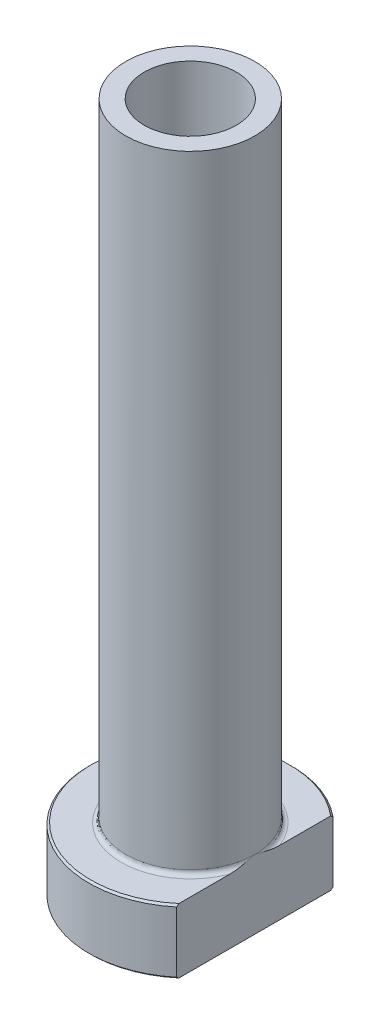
ISO-10303-21;
HEADER;
FILE_DESCRIPTION(('STEP AP214'),'2;1');
FILE_NAME('part.step','',(''),(''),'','','');
FILE_SCHEMA(('AUTOMOTIVE_DESIGN { 1 0 10303 214 1 1 1 1 }'));
ENDSEC;
DATA;
#1=APPLICATION_CONTEXT('core data for automotive mechanical design processes');
#2=APPLICATION_PROTOCOL_DEFINITION('international standard','automotive_design',2000,#1);
#3=PRODUCT_CONTEXT('',#1,'mechanical');
#4=PRODUCT('Part','Part','',(#3));
#5=PRODUCT_RELATED_PRODUCT_CATEGORY('part','',(#4));
#6=PRODUCT_DEFINITION_FORMATION('','',#4);
#7=PRODUCT_DEFINITION_CONTEXT('part definition',#1,'design');
#8=PRODUCT_DEFINITION('design','',#6,#7);
#9=PRODUCT_DEFINITION_SHAPE('','',#8);
#10=(LENGTH_UNIT() NAMED_UNIT(*) SI_UNIT(.MILLI.,.METRE.));
#11=(NAMED_UNIT(*) PLANE_ANGLE_UNIT() SI_UNIT($,.RADIAN.));
#12=(NAMED_UNIT(*) SI_UNIT($,.STERADIAN.) SOLID_ANGLE_UNIT());
#13=UNCERTAINTY_MEASURE_WITH_UNIT(LENGTH_MEASURE(1.E-05),#10,'distance_accuracy_value','');
#14=(GEOMETRIC_REPRESENTATION_CONTEXT(3) GLOBAL_UNCERTAINTY_ASSIGNED_CONTEXT((#13)) GLOBAL_UNIT_ASSIGNED_CONTEXT((#10,
#11,#12)) REPRESENTATION_CONTEXT('',''));
#15=CARTESIAN_POINT('',(0.,0.,0.));
#16=DIRECTION('',(0.,0.,1.));
#17=DIRECTION('',(1.,0.,0.));
#18=AXIS2_PLACEMENT_3D('',#15,#16,#17);
#19=CARTESIAN_POINT('',(0.,92.1876809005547,0.));
#20=DIRECTION('',(0.,1.,0.));
#21=DIRECTION('',(0.,0.,1.));
#22=AXIS2_PLACEMENT_3D('',#19,#20,#21);
#23=CYLINDRICAL_SURFACE('',#22,5.00000000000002);
#24=CARTESIAN_POINT('',(0.,75.,0.));
#25=DIRECTION('',(0.,1.,0.));
#26=DIRECTION('',(0.,0.,1.));
#27=AXIS2_PLACEMENT_3D('',#24,#25,#26);
#28=CIRCLE('',#27,5.00000000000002);
#29=CARTESIAN_POINT('',(0.,75.,5.00000000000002));
#30=VERTEX_POINT('',#29);
#31=EDGE_CURVE('E167',#30,#30,#28,.T.);
#32=ORIENTED_EDGE('',*,*,#31,.T.);
#33=EDGE_LOOP('',(#32));
#34=FACE_BOUND('',#33,.T.);
#35=CARTESIAN_POINT('',(0.,30.,0.));
#36=DIRECTION('',(0.,1.,0.));
#37=DIRECTION('',(0.,0.,1.));
#38=AXIS2_PLACEMENT_3D('',#35,#36,#37);
#39=CIRCLE('',#38,5.00000000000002);
#40=CARTESIAN_POINT('',(0.,30.,5.00000000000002));
#41=VERTEX_POINT('',#40);
#42=EDGE_CURVE('E170',#41,#41,#39,.T.);
#43=ORIENTED_EDGE('',*,*,#42,.F.);
#44=EDGE_LOOP('',(#43));
#45=FACE_BOUND('',#44,.T.);
#46=ADVANCED_FACE('F32',(#34,#45),#23,.F.);
#47=CARTESIAN_POINT('',(-5.00000000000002,75.,0.));
#48=DIRECTION('',(0.,1.,0.));
#49=DIRECTION('',(0.,0.,1.));
#50=AXIS2_PLACEMENT_3D('',#47,#48,#49);
#51=PLANE('',#50);
#52=CARTESIAN_POINT('',(0.,75.,0.));
#53=DIRECTION('',(0.,1.,0.));
#54=DIRECTION('',(0.,0.,1.));
#55=AXIS2_PLACEMENT_3D('',#52,#53,#54);
#56=CIRCLE('',#55,7.);
#57=CARTESIAN_POINT('',(0.,75.,7.));
#58=VERTEX_POINT('',#57);
#59=EDGE_CURVE('E174',#58,#58,#56,.T.);
#60=ORIENTED_EDGE('',*,*,#59,.T.);
#61=EDGE_LOOP('',(#60));
#62=FACE_BOUND('',#61,.T.);
#63=ORIENTED_EDGE('',*,*,#31,.F.);
#64=EDGE_LOOP('',(#63));
#65=FACE_BOUND('',#64,.T.);
#66=ADVANCED_FACE('F157',(#62,#65),#51,.T.);
#67=CARTESIAN_POINT('',(0.,92.1876809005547,0.));
#68=DIRECTION('',(0.,1.,0.));
#69=DIRECTION('',(0.,0.,1.));
#70=AXIS2_PLACEMENT_3D('',#67,#68,#69);
#71=CYLINDRICAL_SURFACE('',#70,6.99999999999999);
#72=CARTESIAN_POINT('',(0.,7.50000000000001,0.));
#73=DIRECTION('',(0.,1.,0.));
#74=DIRECTION('',(0.,0.,1.));
#75=AXIS2_PLACEMENT_3D('',#72,#73,#74);
#76=CIRCLE('',#75,6.99999999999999);
#77=CARTESIAN_POINT('',(6.99999999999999,7.50000000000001,0.));
#78=VERTEX_POINT('',#77);
#79=EDGE_CURVE('E180',#78,#78,#76,.T.);
#80=ORIENTED_EDGE('',*,*,#79,.T.);
#81=EDGE_LOOP('',(#80));
#82=FACE_BOUND('',#81,.T.);
#83=ORIENTED_EDGE('',*,*,#59,.F.);
#84=EDGE_LOOP('',(#83));
#85=FACE_BOUND('',#84,.T.);
#86=ADVANCED_FACE('F162',(#82,#85),#71,.T.);
#87=CARTESIAN_POINT('',(-6.99999999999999,7.,0.));
#88=DIRECTION('',(0.,1.,0.));
#89=DIRECTION('',(0.,0.,1.));
#90=AXIS2_PLACEMENT_3D('',#87,#88,#89);
#91=PLANE('',#90);
#92=DIRECTION('',(0.,0.,1.));
#93=VECTOR('',#92,1.);
#94=CARTESIAN_POINT('',(6.99999999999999,7.,0.));
#95=LINE('',#94,#93);
#96=CARTESIAN_POINT('',(7.,7.,-8.22435407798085));
#97=VERTEX_POINT('',#96);
#98=CARTESIAN_POINT('',(6.99999999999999,7.,-2.69258240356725));
#99=VERTEX_POINT('',#98);
#100=EDGE_CURVE('E54',#97,#99,#95,.T.);
#101=ORIENTED_EDGE('',*,*,#100,.F.);
#102=CARTESIAN_POINT('',(0.,7.,0.));
#103=DIRECTION('',(0.,1.,0.));
#104=DIRECTION('',(0.,0.,1.));
#105=AXIS2_PLACEMENT_3D('',#102,#103,#104);
#106=CIRCLE('',#105,10.8);
#107=CARTESIAN_POINT('',(6.99999999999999,7.,8.22435407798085));
#108=VERTEX_POINT('',#107);
#109=EDGE_CURVE('E186',#97,#108,#106,.T.);
#110=ORIENTED_EDGE('',*,*,#109,.T.);
#111=CARTESIAN_POINT('',(6.99999999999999,7.,2.69258240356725));
#112=VERTEX_POINT('',#111);
#113=EDGE_CURVE('E134',#112,#108,#95,.T.);
#114=ORIENTED_EDGE('',*,*,#113,.F.);
#115=CARTESIAN_POINT('',(0.,7.,0.));
#116=DIRECTION('',(0.,1.,0.));
#117=DIRECTION('',(0.,0.,1.));
#118=AXIS2_PLACEMENT_3D('',#115,#116,#117);
#119=CIRCLE('',#118,7.49999999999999);
#120=EDGE_CURVE('E183',#112,#99,#119,.F.);
#121=ORIENTED_EDGE('',*,*,#120,.T.);
#122=EDGE_LOOP('',(#101,#110,#114,#121));
#123=FACE_BOUND('',#122,.T.);
#124=ADVANCED_FACE('F197',(#123),#91,.T.);
#125=CARTESIAN_POINT('',(0.,92.1876809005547,0.));
#126=DIRECTION('',(0.,1.,0.));
#127=DIRECTION('',(0.,0.,1.));
#128=AXIS2_PLACEMENT_3D('',#125,#126,#127);
#129=CYLINDRICAL_SURFACE('',#128,11.);
#130=DIRECTION('',(0.,-1.,0.));
#131=VECTOR('',#130,1.);
#132=CARTESIAN_POINT('',(6.99999999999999,75.,8.48528137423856));
#133=LINE('',#132,#131);
#134=CARTESIAN_POINT('',(6.99999999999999,6.80000000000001,8.48528137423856));
#135=VERTEX_POINT('',#134);
#136=CARTESIAN_POINT('',(6.99999999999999,0.200000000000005,8.48528137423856));
#137=VERTEX_POINT('',#136);
#138=EDGE_CURVE('E82',#135,#137,#133,.T.);
#139=ORIENTED_EDGE('',*,*,#138,.F.);
#140=CARTESIAN_POINT('',(0.,6.80000000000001,0.));
#141=DIRECTION('',(0.,1.,0.));
#142=DIRECTION('',(0.,0.,1.));
#143=AXIS2_PLACEMENT_3D('',#140,#141,#142);
#144=CIRCLE('',#143,11.);
#145=CARTESIAN_POINT('',(7.,6.80000000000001,-8.48528137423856));
#146=VERTEX_POINT('',#145);
#147=EDGE_CURVE('E95',#135,#146,#144,.F.);
#148=ORIENTED_EDGE('',*,*,#147,.T.);
#149=DIRECTION('',(0.,-1.,0.));
#150=VECTOR('',#149,1.);
#151=CARTESIAN_POINT('',(7.,75.,-8.48528137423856));
#152=LINE('',#151,#150);
#153=CARTESIAN_POINT('',(7.,0.200000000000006,-8.48528137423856));
#154=VERTEX_POINT('',#153);
#155=EDGE_CURVE('E192',#146,#154,#152,.T.);
#156=ORIENTED_EDGE('',*,*,#155,.T.);
#157=CARTESIAN_POINT('',(0.,0.200000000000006,0.));
#158=DIRECTION('',(0.,-1.,0.));
#159=DIRECTION('',(0.,0.,-1.));
#160=AXIS2_PLACEMENT_3D('',#157,#158,#159);
#161=CIRCLE('',#160,11.);
#162=EDGE_CURVE('E98',#154,#137,#161,.F.);
#163=ORIENTED_EDGE('',*,*,#162,.T.);
#164=EDGE_LOOP('',(#139,#148,#156,#163));
#165=FACE_BOUND('',#164,.T.);
#166=ADVANCED_FACE('F190',(#165),#129,.T.);
#167=CARTESIAN_POINT('',(-11.,0.,0.));
#168=DIRECTION('',(0.,-1.,0.));
#169=DIRECTION('',(0.,0.,-1.));
#170=AXIS2_PLACEMENT_3D('',#167,#168,#169);
#171=PLANE('',#170);
#172=CARTESIAN_POINT('',(0.,0.,0.));
#173=DIRECTION('',(0.,-1.,0.));
#174=DIRECTION('',(0.,0.,-1.));
#175=AXIS2_PLACEMENT_3D('',#172,#173,#174);
#176=CIRCLE('',#175,5.74999999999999);
#177=CARTESIAN_POINT('',(0.,0.,-5.74999999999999));
#178=VERTEX_POINT('',#177);
#179=EDGE_CURVE('E40',#178,#178,#176,.F.);
#180=ORIENTED_EDGE('',*,*,#179,.T.);
#181=EDGE_LOOP('',(#180));
#182=FACE_BOUND('',#181,.T.);
#183=DIRECTION('',(0.,0.,-1.));
#184=VECTOR('',#183,1.);
#185=CARTESIAN_POINT('',(6.99999999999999,0.,8.48528137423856));
#186=LINE('',#185,#184);
#187=CARTESIAN_POINT('',(6.99999999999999,0.,8.22435407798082));
#188=VERTEX_POINT('',#187);
#189=CARTESIAN_POINT('',(7.,0.,-8.22435407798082));
#190=VERTEX_POINT('',#189);
#191=EDGE_CURVE('E47',#188,#190,#186,.T.);
#192=ORIENTED_EDGE('',*,*,#191,.F.);
#193=CARTESIAN_POINT('',(0.,0.,0.));
#194=DIRECTION('',(0.,-1.,0.));
#195=DIRECTION('',(0.,0.,-1.));
#196=AXIS2_PLACEMENT_3D('',#193,#194,#195);
#197=CIRCLE('',#196,10.8);
#198=EDGE_CURVE('E92',#188,#190,#197,.T.);
#199=ORIENTED_EDGE('',*,*,#198,.T.);
#200=EDGE_LOOP('',(#192,#199));
#201=FACE_BOUND('',#200,.T.);
#202=ADVANCED_FACE('F91',(#182,#201),#171,.T.);
#203=CARTESIAN_POINT('',(0.,92.1876809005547,0.));
#204=DIRECTION('',(0.,1.,0.));
#205=DIRECTION('',(0.,0.,1.));
#206=AXIS2_PLACEMENT_3D('',#203,#204,#205);
#207=CYLINDRICAL_SURFACE('',#206,5.24999999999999);
#208=CARTESIAN_POINT('',(0.,0.5,0.));
#209=DIRECTION('',(0.,-1.,0.));
#210=DIRECTION('',(0.,0.,-1.));
#211=AXIS2_PLACEMENT_3D('',#208,#209,#210);
#212=CIRCLE('',#211,5.24999999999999);
#213=CARTESIAN_POINT('',(0.,0.5,-5.24999999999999));
#214=VERTEX_POINT('',#213);
#215=EDGE_CURVE('E11',#214,#214,#212,.T.);
#216=ORIENTED_EDGE('',*,*,#215,.T.);
#217=EDGE_LOOP('',(#216));
#218=FACE_BOUND('',#217,.T.);
#219=CARTESIAN_POINT('',(0.,18.,0.));
#220=DIRECTION('',(0.,1.,0.));
#221=DIRECTION('',(0.,0.,1.));
#222=AXIS2_PLACEMENT_3D('',#219,#220,#221);
#223=CIRCLE('',#222,5.24999999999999);
#224=CARTESIAN_POINT('',(0.,18.,5.24999999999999));
#225=VERTEX_POINT('',#224);
#226=EDGE_CURVE('E172',#225,#225,#223,.T.);
#227=ORIENTED_EDGE('',*,*,#226,.T.);
#228=EDGE_LOOP('',(#227));
#229=FACE_BOUND('',#228,.T.);
#230=ADVANCED_FACE('F215',(#218,#229),#207,.F.);
#231=CARTESIAN_POINT('',(0.,18.,0.));
#232=DIRECTION('',(0.,-1.,0.));
#233=DIRECTION('',(0.,0.,-1.));
#234=AXIS2_PLACEMENT_3D('',#231,#232,#233);
#235=CONICAL_SURFACE('',#234,5.24999999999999,0.0208303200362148);
#236=ORIENTED_EDGE('',*,*,#42,.T.);
#237=EDGE_LOOP('',(#236));
#238=FACE_BOUND('',#237,.T.);
#239=ORIENTED_EDGE('',*,*,#226,.F.);
#240=EDGE_LOOP('',(#239));
#241=FACE_BOUND('',#240,.T.);
#242=ADVANCED_FACE('F111',(#238,#241),#235,.F.);
#243=CARTESIAN_POINT('',(0.,7.50000000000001,0.));
#244=DIRECTION('',(0.,1.,0.));
#245=DIRECTION('',(0.,0.,1.));
#246=AXIS2_PLACEMENT_3D('',#243,#244,#245);
#247=TOROIDAL_SURFACE('',#246,7.49999999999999,0.5);
#248=ORIENTED_EDGE('',*,*,#120,.F.);
#249=CARTESIAN_POINT('',(6.99999999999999,7.50000000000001,0.));
#250=CARTESIAN_POINT('',(6.99999999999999,7.5000008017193,-1.25554024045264E-10));
#251=CARTESIAN_POINT('',(7.,7.50000160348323,2.90220199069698E-07));
#252=CARTESIAN_POINT('',(7.,7.50000310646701,1.10846425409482E-06));
#253=CARTESIAN_POINT('',(7.,7.50000379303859,1.65470094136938E-06));
#254=CARTESIAN_POINT('',(7.,7.50000521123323,2.96102727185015E-06));
#255=CARTESIAN_POINT('',(7.,7.50000592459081,3.74204146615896E-06));
#256=CARTESIAN_POINT('',(7.,7.50000721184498,5.36891839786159E-06));
#257=CARTESIAN_POINT('',(7.,7.50000778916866,6.21226313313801E-06));
#258=CARTESIAN_POINT('',(7.,7.50000990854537,9.44889645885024E-06));
#259=CARTESIAN_POINT('',(7.,7.5000113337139,1.19224906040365E-05));
#260=CARTESIAN_POINT('',(7.,7.50001370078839,1.6845303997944E-05));
#261=CARTESIAN_POINT('',(7.,7.50001467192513,1.92810855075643E-05));
#262=CARTESIAN_POINT('',(7.,7.50001870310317,2.9505751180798E-05));
#263=CARTESIAN_POINT('',(7.,7.50002167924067,3.73333802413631E-05));
#264=CARTESIAN_POINT('',(7.,7.50002610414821,5.21820391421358E-05));
#265=CARTESIAN_POINT('',(7.,7.50002771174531,5.91555994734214E-05));
#266=CARTESIAN_POINT('',(7.,7.50003935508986,0.000110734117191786));
#267=CARTESIAN_POINT('',(7.,7.50004810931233,0.000155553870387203));
#268=CARTESIAN_POINT('',(7.,7.5000864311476,0.000332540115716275));
#269=CARTESIAN_POINT('',(7.,7.50012307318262,0.000463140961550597));
#270=CARTESIAN_POINT('',(7.,7.50026565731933,0.000980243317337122));
#271=CARTESIAN_POINT('',(7.,7.50036696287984,0.00136762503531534));
#272=CARTESIAN_POINT('',(7.,7.50077257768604,0.00290683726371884));
#273=CARTESIAN_POINT('',(7.,7.50108269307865,0.00405753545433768));
#274=CARTESIAN_POINT('',(7.,7.50237341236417,0.00885983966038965));
#275=CARTESIAN_POINT('',(7.,7.50334676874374,0.0125128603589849));
#276=CARTESIAN_POINT('',(7.,7.5162718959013,0.0610038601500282));
#277=CARTESIAN_POINT('',(7.,7.5282728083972,0.105832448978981));
#278=CARTESIAN_POINT('',(7.,7.55170994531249,0.193693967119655));
#279=CARTESIAN_POINT('',(7.,7.56314936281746,0.236726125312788));
#280=CARTESIAN_POINT('',(7.,7.5874041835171,0.328321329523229));
#281=CARTESIAN_POINT('',(7.,7.60020832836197,0.376887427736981));
#282=CARTESIAN_POINT('',(7.,7.62578161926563,0.474605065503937));
#283=CARTESIAN_POINT('',(7.,7.63854879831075,0.523757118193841));
#284=CARTESIAN_POINT('',(7.,7.66904753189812,0.642366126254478));
#285=CARTESIAN_POINT('',(7.,7.68665961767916,0.71185401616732));
#286=CARTESIAN_POINT('',(7.,7.72074501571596,0.849103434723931));
#287=CARTESIAN_POINT('',(7.,7.73723627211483,0.916860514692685));
#288=CARTESIAN_POINT('',(7.,7.79038156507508,1.14104210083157));
#289=CARTESIAN_POINT('',(7.,7.82528973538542,1.29788860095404));
#290=CARTESIAN_POINT('',(7.,7.88862298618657,1.61471917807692));
#291=CARTESIAN_POINT('',(7.,7.91697354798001,1.77471883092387));
#292=CARTESIAN_POINT('',(7.,7.95258292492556,2.02253505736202));
#293=CARTESIAN_POINT('',(7.,7.9635525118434,2.10981398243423));
#294=CARTESIAN_POINT('',(7.,7.98165287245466,2.28476193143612));
#295=CARTESIAN_POINT('',(7.,7.98878459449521,2.37243085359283));
#296=CARTESIAN_POINT('',(7.,7.99822919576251,2.54760327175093));
#297=CARTESIAN_POINT('',(7.,8.0005658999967,2.63510541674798));
#298=CARTESIAN_POINT('',(7.,7.99919996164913,2.81004074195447));
#299=CARTESIAN_POINT('',(7.,7.99550272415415,2.89747391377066));
#300=CARTESIAN_POINT('',(7.,7.98391011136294,3.02882076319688));
#301=CARTESIAN_POINT('',(7.,7.97897237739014,3.07299684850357));
#302=CARTESIAN_POINT('',(7.,7.9666545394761,3.1610540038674));
#303=CARTESIAN_POINT('',(7.,7.95927246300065,3.20493480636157));
#304=CARTESIAN_POINT('',(7.,7.94168688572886,3.29163191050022));
#305=CARTESIAN_POINT('',(7.,7.93151559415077,3.33445462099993));
#306=CARTESIAN_POINT('',(7.,7.90768392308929,3.41909658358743));
#307=CARTESIAN_POINT('',(7.,7.89402748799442,3.46091691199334));
#308=CARTESIAN_POINT('',(7.,7.8621470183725,3.54331777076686));
#309=CARTESIAN_POINT('',(7.,7.84387618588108,3.58388050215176));
#310=CARTESIAN_POINT('',(7.,7.8014589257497,3.66184445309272));
#311=CARTESIAN_POINT('',(7.,7.77733569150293,3.69925738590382));
#312=CARTESIAN_POINT('',(7.,7.7371401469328,3.74836513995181));
#313=CARTESIAN_POINT('',(7.,7.72423208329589,3.76263695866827));
#314=CARTESIAN_POINT('',(7.,7.6967376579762,3.78951670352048));
#315=CARTESIAN_POINT('',(7.,7.682150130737,3.80212346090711));
#316=CARTESIAN_POINT('',(7.,7.65099843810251,3.82514624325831));
#317=CARTESIAN_POINT('',(7.,7.63441049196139,3.83553078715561));
#318=CARTESIAN_POINT('',(7.,7.59955798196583,3.85294010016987));
#319=CARTESIAN_POINT('',(7.,7.58129885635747,3.85997533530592));
#320=CARTESIAN_POINT('',(7.,7.54906837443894,3.86837810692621));
#321=CARTESIAN_POINT('',(7.,7.53536870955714,3.87079233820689));
#322=CARTESIAN_POINT('',(7.,7.50775756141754,3.87325240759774));
#323=CARTESIAN_POINT('',(7.,7.49384618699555,3.87329942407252));
#324=CARTESIAN_POINT('',(7.,7.46623771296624,3.87102093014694));
#325=CARTESIAN_POINT('',(7.,7.45254041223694,3.8686978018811));
#326=CARTESIAN_POINT('',(7.,7.42569741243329,3.86188775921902));
#327=CARTESIAN_POINT('',(7.,7.4125521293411,3.85739924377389));
#328=CARTESIAN_POINT('',(7.,7.38259319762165,3.84468786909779));
#329=CARTESIAN_POINT('',(7.,7.36610215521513,3.83570823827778));
#330=CARTESIAN_POINT('',(7.,7.33476729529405,3.81523202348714));
#331=CARTESIAN_POINT('',(7.,7.31992737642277,3.80372966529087));
#332=CARTESIAN_POINT('',(7.,7.28371925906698,3.77170797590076));
#333=CARTESIAN_POINT('',(7.,7.26356272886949,3.7498305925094));
#334=CARTESIAN_POINT('',(7.,7.22671696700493,3.70338283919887));
#335=CARTESIAN_POINT('',(7.,7.21003361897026,3.67880800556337));
#336=CARTESIAN_POINT('',(7.,7.18026553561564,3.62921731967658));
#337=CARTESIAN_POINT('',(7.,7.16704475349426,3.60428175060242));
#338=CARTESIAN_POINT('',(7.,7.14275069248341,3.55337478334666));
#339=CARTESIAN_POINT('',(7.,7.13167947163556,3.52740242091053));
#340=CARTESIAN_POINT('',(7.,7.10104499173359,3.44809573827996));
#341=CARTESIAN_POINT('',(7.,7.08424174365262,3.39369851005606));
#342=CARTESIAN_POINT('',(7.,7.05431378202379,3.27667221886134));
#343=CARTESIAN_POINT('',(7.,7.04191718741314,3.21386807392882));
#344=CARTESIAN_POINT('',(7.,7.02234605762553,3.08735184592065));
#345=CARTESIAN_POINT('',(7.,7.01518234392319,3.02363815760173));
#346=CARTESIAN_POINT('',(7.,7.00517826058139,2.89779001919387));
#347=CARTESIAN_POINT('',(7.,7.00221627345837,2.83566460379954));
#348=CARTESIAN_POINT('',(7.,6.99952325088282,2.71160626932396));
#349=CARTESIAN_POINT('',(7.,6.99977918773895,2.64967358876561));
#350=CARTESIAN_POINT('',(7.,7.0037776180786,2.4940781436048));
#351=CARTESIAN_POINT('',(7.,7.00924384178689,2.40046113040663));
#352=CARTESIAN_POINT('',(7.,7.02494106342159,2.21367396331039));
#353=CARTESIAN_POINT('',(7.,7.03517106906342,2.12050372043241));
#354=CARTESIAN_POINT('',(7.,7.05969765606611,1.93249035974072));
#355=CARTESIAN_POINT('',(7.,7.07408383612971,1.83765914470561));
#356=CARTESIAN_POINT('',(7.,7.10603300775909,1.64829340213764));
#357=CARTESIAN_POINT('',(7.,7.12360402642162,1.55376025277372));
#358=CARTESIAN_POINT('',(7.,7.1680646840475,1.33086107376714));
#359=CARTESIAN_POINT('',(7.,7.19601783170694,1.20270896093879));
#360=CARTESIAN_POINT('',(7.,7.25475947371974,0.948586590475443));
#361=CARTESIAN_POINT('',(7.,7.28551257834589,0.822607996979));
#362=CARTESIAN_POINT('',(7.,7.33123897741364,0.641334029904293));
#363=CARTESIAN_POINT('',(7.,7.34543722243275,0.585840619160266));
#364=CARTESIAN_POINT('',(7.,7.37418243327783,0.474686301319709));
#365=CARTESIAN_POINT('',(7.,7.38873064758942,0.419025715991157));
#366=CARTESIAN_POINT('',(7.,7.41873357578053,0.305011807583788));
#367=CARTESIAN_POINT('',(7.,7.43419762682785,0.246660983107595));
#368=CARTESIAN_POINT('',(7.,7.46502361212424,0.130933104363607));
#369=CARTESIAN_POINT('',(7.,7.48038319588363,0.0735554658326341));
#370=CARTESIAN_POINT('',(7.,7.49665455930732,0.0125077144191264));
#371=CARTESIAN_POINT('',(7.,7.49762931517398,0.00884956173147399));
#372=CARTESIAN_POINT('',(7.,7.49892036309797,0.00404608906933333));
#373=CARTESIAN_POINT('',(7.,7.49922940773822,0.0028993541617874));
#374=CARTESIAN_POINT('',(7.,7.49963371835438,0.00136508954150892));
#375=CARTESIAN_POINT('',(7.,7.49973476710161,0.000978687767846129));
#376=CARTESIAN_POINT('',(7.,7.49987704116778,0.000462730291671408));
#377=CARTESIAN_POINT('',(7.,7.49991363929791,0.000332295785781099));
#378=CARTESIAN_POINT('',(7.,7.49995192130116,0.000155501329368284));
#379=CARTESIAN_POINT('',(7.,7.49996067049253,0.000110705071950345));
#380=CARTESIAN_POINT('',(7.,7.49997230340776,5.91504837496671E-05));
#381=CARTESIAN_POINT('',(7.,7.49997390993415,5.21782439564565E-05));
#382=CARTESIAN_POINT('',(7.,7.49997833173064,3.73322789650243E-05));
#383=CARTESIAN_POINT('',(7.,7.49998130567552,2.95059531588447E-05));
#384=CARTESIAN_POINT('',(7.,7.49998533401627,1.92826342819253E-05));
#385=CARTESIAN_POINT('',(7.,7.4999863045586,1.68469515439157E-05));
#386=CARTESIAN_POINT('',(7.,7.49998867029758,1.19242365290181E-05));
#387=CARTESIAN_POINT('',(7.,7.49999009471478,9.45062992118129E-06));
#388=CARTESIAN_POINT('',(7.,7.499992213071,6.21386409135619E-06));
#389=CARTESIAN_POINT('',(7.,7.49999279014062,5.37045268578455E-06));
#390=CARTESIAN_POINT('',(7.,7.4999940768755,3.74339655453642E-06));
#391=CARTESIAN_POINT('',(7.,7.49999478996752,2.96226828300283E-06));
#392=CARTESIAN_POINT('',(7.,7.49999620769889,1.65567322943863E-06));
#393=CARTESIAN_POINT('',(7.,7.49999689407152,1.10929173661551E-06));
#394=CARTESIAN_POINT('',(7.,7.49999839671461,2.90683077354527E-07));
#395=CARTESIAN_POINT('',(6.99999999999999,7.49999919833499,1.25546956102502E-10));
#396=CARTESIAN_POINT('',(6.99999999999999,7.50000000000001,0.));
#397=B_SPLINE_CURVE_WITH_KNOTS('',3,(#249,#250,#251,#252,#253,#254,#255,#256,#257,#258,#259,
#260,#261,#262,#263,#264,#265,#266,#267,#268,#269,#270,#271,#272,#273,#274,#275,#276,#277,#278,
#279,#280,#281,#282,#283,#284,#285,#286,#287,#288,#289,#290,#291,#292,#293,#294,#295,#296,#297,
#298,#299,#300,#301,#302,#303,#304,#305,#306,#307,#308,#309,#310,#311,#312,#313,#314,#315,#316,
#317,#318,#319,#320,#321,#322,#323,#324,#325,#326,#327,#328,#329,#330,#331,#332,#333,#334,#335,
#336,#337,#338,#339,#340,#341,#342,#343,#344,#345,#346,#347,#348,#349,#350,#351,#352,#353,#354,
#355,#356,#357,#358,#359,#360,#361,#362,#363,#364,#365,#366,#367,#368,#369,#370,#371,#372,#373,
#374,#375,#376,#377,#378,#379,#380,#381,#382,#383,#384,#385,#386,#387,#388,#389,#390,#391,#392,
#393,#394,#395,#396),.UNSPECIFIED.,.T.,.F.,(4,2,2,2,2,2,2,2,2,2,2,2,2,2,2,2,2,2,2,2,2,2,2,2,2,2,
2,2,2,2,2,2,2,2,2,2,2,2,2,2,2,2,2,2,2,2,2,2,2,2,2,2,2,2,2,2,2,2,2,2,2,2,2,2,2,2,2,2,2,2,2,2,2,
4),(0.,2.42201532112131E-06,5.05305063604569E-06,8.20814364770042E-06,1.12722964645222E-05,
1.98044055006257E-05,2.7664211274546E-05,5.27403892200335E-05,7.4183084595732E-05,
0.000211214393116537,0.00061773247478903,0.00181938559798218,0.00539412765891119,
0.016736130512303,0.155952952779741,0.289534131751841,0.440210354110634,0.592559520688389,
0.80761174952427,1.01681499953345,1.49878389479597,1.98598665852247,2.24981935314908,
2.51358682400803,2.77604050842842,3.03825922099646,3.17156039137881,3.30496939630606,
3.43689837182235,3.56867869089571,3.70185328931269,3.83450849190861,3.89212877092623,
3.94978928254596,4.00821928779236,4.06646549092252,4.10801107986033,4.14953598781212,
4.19101920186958,4.23253313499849,4.28854866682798,4.34469377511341,4.43343413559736,
4.52232362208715,4.60686785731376,4.69149264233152,4.86185145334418,5.05362927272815,
5.24580256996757,5.43229132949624,5.6180253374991,5.89918385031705,6.18028382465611,
6.46796485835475,6.75638131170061,7.14981284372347,7.53882346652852,7.71066604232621,
7.88325629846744,8.06435328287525,8.24254095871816,8.2538989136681,8.25746134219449,
8.25865995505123,8.25906595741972,8.25920291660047,8.25922435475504,8.25924942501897,
8.25925728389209,8.25926581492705,8.25926887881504,8.2592720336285,8.25927466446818,
8.25927708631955),.UNSPECIFIED.);
#398=EDGE_CURVE('E126',#112,#78,#397,.T.);
#399=ORIENTED_EDGE('',*,*,#398,.T.);
#400=ORIENTED_EDGE('',*,*,#79,.F.);
#401=CARTESIAN_POINT('',(6.99999999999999,7.50000000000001,0.));
#402=CARTESIAN_POINT('',(6.99999999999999,7.49999919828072,1.25555477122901E-10));
#403=CARTESIAN_POINT('',(7.,7.49999839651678,-2.90220197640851E-07));
#404=CARTESIAN_POINT('',(7.,7.49999689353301,-1.10846425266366E-06));
#405=CARTESIAN_POINT('',(7.,7.49999620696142,-1.65470093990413E-06));
#406=CARTESIAN_POINT('',(7.,7.49999478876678,-2.96102727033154E-06));
#407=CARTESIAN_POINT('',(7.,7.49999407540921,-3.74204146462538E-06));
#408=CARTESIAN_POINT('',(7.,7.49999278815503,-5.36891839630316E-06));
#409=CARTESIAN_POINT('',(7.,7.49999221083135,-6.21226313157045E-06));
#410=CARTESIAN_POINT('',(7.,7.49999009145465,-9.44889645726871E-06));
#411=CARTESIAN_POINT('',(7.,7.49998866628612,-1.19224906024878E-05));
#412=CARTESIAN_POINT('',(7.,7.49998629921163,-1.68453039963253E-05));
#413=CARTESIAN_POINT('',(7.,7.49998532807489,-1.92810855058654E-05));
#414=CARTESIAN_POINT('',(7.,7.49998129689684,-2.95057511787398E-05));
#415=CARTESIAN_POINT('',(7.,7.49997832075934,-3.73333802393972E-05));
#416=CARTESIAN_POINT('',(7.,7.4999738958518,-5.21820391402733E-05));
#417=CARTESIAN_POINT('',(7.,7.4999722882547,-5.91555994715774E-05));
#418=CARTESIAN_POINT('',(7.,7.49996064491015,-0.000110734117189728));
#419=CARTESIAN_POINT('',(7.,7.49995189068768,-0.000155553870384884));
#420=CARTESIAN_POINT('',(7.,7.49991356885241,-0.000332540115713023));
#421=CARTESIAN_POINT('',(7.,7.49987692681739,-0.000463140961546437));
#422=CARTESIAN_POINT('',(7.,7.49973434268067,-0.000980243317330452));
#423=CARTESIAN_POINT('',(7.,7.49963303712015,-0.00136762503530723));
#424=CARTESIAN_POINT('',(7.,7.49922742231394,-0.00290683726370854));
#425=CARTESIAN_POINT('',(7.,7.49891730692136,-0.00405753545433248));
#426=CARTESIAN_POINT('',(7.,7.49762658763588,-0.00885983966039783));
#427=CARTESIAN_POINT('',(7.,7.49665323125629,-0.0125128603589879));
#428=CARTESIAN_POINT('',(7.,7.48372810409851,-0.0610038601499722));
#429=CARTESIAN_POINT('',(7.,7.47172719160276,-0.105832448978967));
#430=CARTESIAN_POINT('',(7.,7.44829005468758,-0.193693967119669));
#431=CARTESIAN_POINT('',(7.,7.43685063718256,-0.23672612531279));
#432=CARTESIAN_POINT('',(7.,7.4125958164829,-0.328321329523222));
#433=CARTESIAN_POINT('',(7.,7.39979167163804,-0.376887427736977));
#434=CARTESIAN_POINT('',(7.,7.37421838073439,-0.474605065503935));
#435=CARTESIAN_POINT('',(7.,7.36145120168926,-0.523757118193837));
#436=CARTESIAN_POINT('',(7.,7.33095246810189,-0.642366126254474));
#437=CARTESIAN_POINT('',(7.,7.31334038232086,-0.711854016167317));
#438=CARTESIAN_POINT('',(7.,7.27925498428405,-0.84910343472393));
#439=CARTESIAN_POINT('',(7.,7.26276372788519,-0.916860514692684));
#440=CARTESIAN_POINT('',(7.,7.20961843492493,-1.14104210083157));
#441=CARTESIAN_POINT('',(7.,7.17471026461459,-1.29788860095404));
#442=CARTESIAN_POINT('',(7.,7.11137701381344,-1.61471917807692));
#443=CARTESIAN_POINT('',(7.,7.08302645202,-1.77471883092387));
#444=CARTESIAN_POINT('',(7.,7.04741707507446,-2.02253505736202));
#445=CARTESIAN_POINT('',(7.,7.03644748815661,-2.10981398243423));
#446=CARTESIAN_POINT('',(7.,7.01834712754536,-2.28476193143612));
#447=CARTESIAN_POINT('',(7.,7.0112154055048,-2.37243085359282));
#448=CARTESIAN_POINT('',(7.,7.0017708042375,-2.54760327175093));
#449=CARTESIAN_POINT('',(7.,6.99943410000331,-2.63510541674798));
#450=CARTESIAN_POINT('',(7.,7.00080003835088,-2.81004074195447));
#451=CARTESIAN_POINT('',(7.,7.00449727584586,-2.89747391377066));
#452=CARTESIAN_POINT('',(7.,7.01608988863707,-3.02882076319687));
#453=CARTESIAN_POINT('',(7.,7.02102762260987,-3.07299684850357));
#454=CARTESIAN_POINT('',(7.,7.03334546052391,-3.1610540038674));
#455=CARTESIAN_POINT('',(7.,7.04072753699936,-3.20493480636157));
#456=CARTESIAN_POINT('',(7.,7.05831311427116,-3.29163191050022));
#457=CARTESIAN_POINT('',(7.,7.06848440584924,-3.33445462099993));
#458=CARTESIAN_POINT('',(7.,7.09231607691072,-3.41909658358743));
#459=CARTESIAN_POINT('',(7.,7.10597251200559,-3.46091691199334));
#460=CARTESIAN_POINT('',(7.,7.13785298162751,-3.54331777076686));
#461=CARTESIAN_POINT('',(7.,7.15612381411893,-3.58388050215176));
#462=CARTESIAN_POINT('',(7.,7.19854107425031,-3.66184445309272));
#463=CARTESIAN_POINT('',(7.,7.22266430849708,-3.69925738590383));
#464=CARTESIAN_POINT('',(7.,7.26285985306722,-3.74836513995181));
#465=CARTESIAN_POINT('',(7.,7.27576791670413,-3.76263695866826));
#466=CARTESIAN_POINT('',(7.,7.30326234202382,-3.78951670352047));
#467=CARTESIAN_POINT('',(7.,7.31784986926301,-3.80212346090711));
#468=CARTESIAN_POINT('',(7.,7.3490015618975,-3.82514624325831));
#469=CARTESIAN_POINT('',(7.,7.36558950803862,-3.83553078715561));
#470=CARTESIAN_POINT('',(7.,7.40044201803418,-3.85294010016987));
#471=CARTESIAN_POINT('',(7.,7.41870114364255,-3.85997533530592));
#472=CARTESIAN_POINT('',(7.,7.45093162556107,-3.86837810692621));
#473=CARTESIAN_POINT('',(7.,7.46463129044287,-3.87079233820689));
#474=CARTESIAN_POINT('',(7.,7.49224243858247,-3.87325240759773));
#475=CARTESIAN_POINT('',(7.,7.50615381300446,-3.87329942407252));
#476=CARTESIAN_POINT('',(7.,7.53376228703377,-3.87102093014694));
#477=CARTESIAN_POINT('',(7.,7.54745958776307,-3.8686978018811));
#478=CARTESIAN_POINT('',(7.,7.57430258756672,-3.86188775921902));
#479=CARTESIAN_POINT('',(7.,7.58744787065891,-3.85739924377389));
#480=CARTESIAN_POINT('',(7.,7.61740680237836,-3.84468786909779));
#481=CARTESIAN_POINT('',(7.,7.63389784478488,-3.83570823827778));
#482=CARTESIAN_POINT('',(7.,7.66523270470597,-3.81523202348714));
#483=CARTESIAN_POINT('',(7.,7.68007262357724,-3.80372966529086));
#484=CARTESIAN_POINT('',(7.,7.71628074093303,-3.77170797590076));
#485=CARTESIAN_POINT('',(7.,7.73643727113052,-3.7498305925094));
#486=CARTESIAN_POINT('',(7.,7.77328303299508,-3.70338283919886));
#487=CARTESIAN_POINT('',(7.,7.78996638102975,-3.67880800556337));
#488=CARTESIAN_POINT('',(7.,7.81973446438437,-3.62921731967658));
#489=CARTESIAN_POINT('',(7.,7.83295524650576,-3.60428175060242));
#490=CARTESIAN_POINT('',(7.,7.8572493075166,-3.55337478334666));
#491=CARTESIAN_POINT('',(7.,7.86832052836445,-3.52740242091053));
#492=CARTESIAN_POINT('',(7.,7.89895500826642,-3.44809573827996));
#493=CARTESIAN_POINT('',(7.,7.91575825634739,-3.39369851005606));
#494=CARTESIAN_POINT('',(7.,7.94568621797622,-3.27667221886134));
#495=CARTESIAN_POINT('',(7.,7.95808281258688,-3.21386807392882));
#496=CARTESIAN_POINT('',(7.,7.97765394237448,-3.08735184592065));
#497=CARTESIAN_POINT('',(7.,7.98481765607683,-3.02363815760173));
#498=CARTESIAN_POINT('',(7.,7.99482173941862,-2.89779001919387));
#499=CARTESIAN_POINT('',(7.,7.99778372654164,-2.83566460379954));
#500=CARTESIAN_POINT('',(7.,8.00047674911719,-2.71160626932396));
#501=CARTESIAN_POINT('',(7.,8.00022081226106,-2.64967358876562));
#502=CARTESIAN_POINT('',(7.,7.99622238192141,-2.49407814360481));
#503=CARTESIAN_POINT('',(7.,7.99075615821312,-2.40046113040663));
#504=CARTESIAN_POINT('',(7.,7.97505893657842,-2.21367396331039));
#505=CARTESIAN_POINT('',(7.,7.9648289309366,-2.12050372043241));
#506=CARTESIAN_POINT('',(7.,7.9403023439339,-1.93249035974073));
#507=CARTESIAN_POINT('',(7.,7.92591616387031,-1.83765914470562));
#508=CARTESIAN_POINT('',(7.,7.89396699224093,-1.64829340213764));
#509=CARTESIAN_POINT('',(7.,7.87639597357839,-1.55376025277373));
#510=CARTESIAN_POINT('',(7.,7.83193531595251,-1.33086107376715));
#511=CARTESIAN_POINT('',(7.,7.80398216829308,-1.2027089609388));
#512=CARTESIAN_POINT('',(7.,7.74524052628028,-0.948586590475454));
#513=CARTESIAN_POINT('',(7.,7.71448742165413,-0.822607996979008));
#514=CARTESIAN_POINT('',(7.,7.66876102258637,-0.641334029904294));
#515=CARTESIAN_POINT('',(7.,7.65456277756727,-0.585840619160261));
#516=CARTESIAN_POINT('',(7.,7.62581756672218,-0.474686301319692));
#517=CARTESIAN_POINT('',(7.,7.61126935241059,-0.419025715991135));
#518=CARTESIAN_POINT('',(7.,7.58126642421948,-0.305011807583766));
#519=CARTESIAN_POINT('',(7.,7.56580237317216,-0.246660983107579));
#520=CARTESIAN_POINT('',(7.,7.53497638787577,-0.130933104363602));
#521=CARTESIAN_POINT('',(7.,7.51961680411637,-0.0735554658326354));
#522=CARTESIAN_POINT('',(7.,7.50334544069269,-0.0125077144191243));
#523=CARTESIAN_POINT('',(7.,7.50237068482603,-0.00884956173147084));
#524=CARTESIAN_POINT('',(7.,7.50107963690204,-0.00404608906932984));
#525=CARTESIAN_POINT('',(7.,7.50077059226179,-0.00289935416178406));
#526=CARTESIAN_POINT('',(7.,7.50036628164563,-0.00136508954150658));
#527=CARTESIAN_POINT('',(7.,7.5002652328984,-0.000978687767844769));
#528=CARTESIAN_POINT('',(7.,7.50012295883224,-0.000462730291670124));
#529=CARTESIAN_POINT('',(7.,7.50008636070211,-0.000332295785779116));
#530=CARTESIAN_POINT('',(7.,7.50004807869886,-0.000155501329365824));
#531=CARTESIAN_POINT('',(7.,7.50003932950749,-0.000110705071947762));
#532=CARTESIAN_POINT('',(7.,7.50002769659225,-5.9150483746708E-05));
#533=CARTESIAN_POINT('',(7.,7.50002609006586,-5.21782439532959E-05));
#534=CARTESIAN_POINT('',(7.,7.50002166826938,-3.733227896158E-05));
#535=CARTESIAN_POINT('',(7.,7.50001869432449,-2.9505953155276E-05));
#536=CARTESIAN_POINT('',(7.,7.50001466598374,-1.92826342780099E-05));
#537=CARTESIAN_POINT('',(7.,7.50001369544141,-1.68469515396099E-05));
#538=CARTESIAN_POINT('',(7.,7.50001132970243,-1.19242365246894E-05));
#539=CARTESIAN_POINT('',(7.,7.50000990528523,-9.45062991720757E-06));
#540=CARTESIAN_POINT('',(7.,7.50000778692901,-6.21386408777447E-06));
#541=CARTESIAN_POINT('',(7.,7.5000072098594,-5.37045268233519E-06));
#542=CARTESIAN_POINT('',(7.,7.50000592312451,-3.74339655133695E-06));
#543=CARTESIAN_POINT('',(7.,7.50000521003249,-2.96226827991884E-06));
#544=CARTESIAN_POINT('',(7.,7.50000379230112,-1.65567322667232E-06));
#545=CARTESIAN_POINT('',(7.,7.50000310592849,-1.10929173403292E-06));
#546=CARTESIAN_POINT('',(7.,7.5000016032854,-2.90683075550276E-07));
#547=CARTESIAN_POINT('',(6.99999999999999,7.50000080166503,-1.25545546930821E-10));
#548=CARTESIAN_POINT('',(6.99999999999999,7.50000000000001,0.));
#549=B_SPLINE_CURVE_WITH_KNOTS('',3,(#401,#402,#403,#404,#405,#406,#407,#408,#409,#410,#411,
#412,#413,#414,#415,#416,#417,#418,#419,#420,#421,#422,#423,#424,#425,#426,#427,#428,#429,#430,
#431,#432,#433,#434,#435,#436,#437,#438,#439,#440,#441,#442,#443,#444,#445,#446,#447,#448,#449,
#450,#451,#452,#453,#454,#455,#456,#457,#458,#459,#460,#461,#462,#463,#464,#465,#466,#467,#468,
#469,#470,#471,#472,#473,#474,#475,#476,#477,#478,#479,#480,#481,#482,#483,#484,#485,#486,#487,
#488,#489,#490,#491,#492,#493,#494,#495,#496,#497,#498,#499,#500,#501,#502,#503,#504,#505,#506,
#507,#508,#509,#510,#511,#512,#513,#514,#515,#516,#517,#518,#519,#520,#521,#522,#523,#524,#525,
#526,#527,#528,#529,#530,#531,#532,#533,#534,#535,#536,#537,#538,#539,#540,#541,#542,#543,#544,
#545,#546,#547,#548),.UNSPECIFIED.,.T.,.F.,(4,2,2,2,2,2,2,2,2,2,2,2,2,2,2,2,2,2,2,2,2,2,2,2,2,2,
2,2,2,2,2,2,2,2,2,2,2,2,2,2,2,2,2,2,2,2,2,2,2,2,2,2,2,2,2,2,2,2,2,2,2,2,2,2,2,2,2,2,2,2,2,2,2,
4),(0.,2.42201532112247E-06,5.05305063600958E-06,8.20814364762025E-06,1.12722964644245E-05,
1.98044055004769E-05,2.76642112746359E-05,5.27403892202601E-05,7.4183084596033E-05,
0.000211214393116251,0.000617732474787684,0.0018193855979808,0.00539412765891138,
0.016736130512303,0.155952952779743,0.289534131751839,0.440210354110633,0.592559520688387,
0.807611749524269,1.01681499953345,1.49878389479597,1.98598665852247,2.24981935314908,
2.51358682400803,2.77604050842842,3.03825922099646,3.17156039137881,3.30496939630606,
3.43689837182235,3.56867869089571,3.70185328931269,3.83450849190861,3.89212877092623,
3.94978928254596,4.00821928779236,4.06646549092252,4.10801107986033,4.14953598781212,
4.19101920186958,4.23253313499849,4.28854866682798,4.34469377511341,4.43343413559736,
4.52232362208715,4.60686785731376,4.69149264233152,4.86185145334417,5.05362927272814,
5.24580256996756,5.43229132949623,5.61802533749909,5.89918385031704,6.1802838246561,
6.46796485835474,6.75638131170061,7.14981284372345,7.53882346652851,7.71066604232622,
7.88325629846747,8.06435328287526,8.24254095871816,8.2538989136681,8.25746134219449,
8.25865995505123,8.25906595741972,8.25920291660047,8.25922435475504,8.25924942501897,
8.25925728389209,8.25926581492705,8.25926887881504,8.2592720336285,8.25927466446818,
8.25927708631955),.UNSPECIFIED.);
#550=EDGE_CURVE('E135',#78,#99,#549,.T.);
#551=ORIENTED_EDGE('',*,*,#550,.T.);
#552=EDGE_LOOP('',(#248,#399,#400,#551));
#553=FACE_BOUND('',#552,.T.);
#554=ADVANCED_FACE('F141',(#553),#247,.F.);
#555=CARTESIAN_POINT('',(0.,7.00000000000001,0.));
#556=DIRECTION('',(0.,-1.,0.));
#557=DIRECTION('',(0.,0.,-1.));
#558=AXIS2_PLACEMENT_3D('',#555,#556,#557);
#559=CONICAL_SURFACE('',#558,10.8,0.785398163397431);
#560=CARTESIAN_POINT('',(7.,-2.13774979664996,-18.6685261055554));
#561=CARTESIAN_POINT('',(7.,-1.86574872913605,-18.3780244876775));
#562=CARTESIAN_POINT('',(7.,-1.59415659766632,-18.0871392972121));
#563=CARTESIAN_POINT('',(7.,-1.0519287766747,-17.5044755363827));
#564=CARTESIAN_POINT('',(7.,-0.781293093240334,-17.2126969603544));
#565=CARTESIAN_POINT('',(7.,-0.241050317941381,-16.628048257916));
#566=CARTESIAN_POINT('',(7.,0.0285564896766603,-16.3351778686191));
#567=CARTESIAN_POINT('',(7.,0.566485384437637,-15.7482616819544));
#568=CARTESIAN_POINT('',(7.,0.834807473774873,-15.4542158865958));
#569=CARTESIAN_POINT('',(7.,1.64198377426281,-14.5651645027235));
#570=CARTESIAN_POINT('',(7.,2.17856420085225,-13.9680841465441));
#571=CARTESIAN_POINT('',(7.,2.97696333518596,-13.0668144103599));
#572=CARTESIAN_POINT('',(7.,3.24199785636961,-12.7654727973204));
#573=CARTESIAN_POINT('',(7.,3.76945856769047,-12.1605141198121));
#574=CARTESIAN_POINT('',(7.,4.03188476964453,-11.856897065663));
#575=CARTESIAN_POINT('',(7.,4.50733797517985,-11.3009625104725));
#576=CARTESIAN_POINT('',(7.,4.72088020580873,-11.0490858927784));
#577=CARTESIAN_POINT('',(7.,5.14538078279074,-10.5431655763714));
#578=CARTESIAN_POINT('',(7.,5.3563391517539,-10.2891218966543));
#579=CARTESIAN_POINT('',(7.,5.77522964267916,-9.77836737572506));
#580=CARTESIAN_POINT('',(7.,5.98316044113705,-9.5216554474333));
#581=CARTESIAN_POINT('',(7.,6.39521098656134,-9.00519084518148));
#582=CARTESIAN_POINT('',(7.,6.59933078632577,-8.74543821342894));
#583=CARTESIAN_POINT('',(7.,7.00243445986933,-8.22283607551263));
#584=CARTESIAN_POINT('',(7.,7.20142819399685,-7.95999419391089));
#585=CARTESIAN_POINT('',(7.,7.59353840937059,-7.42991856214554));
#586=CARTESIAN_POINT('',(7.,7.78665447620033,-7.16268450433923));
#587=CARTESIAN_POINT('',(7.,8.16523718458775,-6.62311113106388));
#588=CARTESIAN_POINT('',(7.,8.3507091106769,-6.35077553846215));
#589=CARTESIAN_POINT('',(7.,8.71189725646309,-5.79973731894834));
#590=CARTESIAN_POINT('',(7.,8.88761537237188,-5.52103594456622));
#591=CARTESIAN_POINT('',(7.,9.19554959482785,-5.00707921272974));
#592=CARTESIAN_POINT('',(7.,9.32988075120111,-4.77309669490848));
#593=CARTESIAN_POINT('',(7.,9.58764253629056,-4.29911523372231));
#594=CARTESIAN_POINT('',(7.,9.71107181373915,-4.05911554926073));
#595=CARTESIAN_POINT('',(7.,9.94390907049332,-3.57263619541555));
#596=CARTESIAN_POINT('',(7.,10.0533307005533,-3.32616312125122));
#597=CARTESIAN_POINT('',(7.,10.2545146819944,-2.82607166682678));
#598=CARTESIAN_POINT('',(7.,10.3462820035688,-2.57245532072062));
#599=CARTESIAN_POINT('',(7.,10.4907049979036,-2.11254447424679));
#600=CARTESIAN_POINT('',(7.,10.5475277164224,-1.90756611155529));
#601=CARTESIAN_POINT('',(7.,10.6452043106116,-1.49381161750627));
#602=CARTESIAN_POINT('',(7.,10.68606033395,-1.28503600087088));
#603=CARTESIAN_POINT('',(7.,10.749755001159,-0.865342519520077));
#604=CARTESIAN_POINT('',(7.,10.772646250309,-0.654432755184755));
#605=CARTESIAN_POINT('',(7.,10.7993569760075,-0.231396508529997));
#606=CARTESIAN_POINT('',(7.,10.8031771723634,-0.0192700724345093));
#607=CARTESIAN_POINT('',(7.,10.791517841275,0.404715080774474));
#608=CARTESIAN_POINT('',(7.,10.7760135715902,0.616573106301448));
#609=CARTESIAN_POINT('',(7.,10.726541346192,1.03810446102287));
#610=CARTESIAN_POINT('',(7.,10.692571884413,1.24777761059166));
#611=CARTESIAN_POINT('',(7.,10.6077703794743,1.66430273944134));
#612=CARTESIAN_POINT('',(7.,10.5568873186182,1.87114418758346));
#613=CARTESIAN_POINT('',(7.,10.4404729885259,2.2806127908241));
#614=CARTESIAN_POINT('',(7.,10.3749414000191,2.48323985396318));
#615=CARTESIAN_POINT('',(7.,10.2190980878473,2.91860265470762));
#616=CARTESIAN_POINT('',(7.,10.126461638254,3.15050038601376));
#617=CARTESIAN_POINT('',(7.,9.92740958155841,3.6083545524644));
#618=CARTESIAN_POINT('',(7.,9.82098769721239,3.83430822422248));
#619=CARTESIAN_POINT('',(7.,9.59695142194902,4.28105341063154));
#620=CARTESIAN_POINT('',(6.99999999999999,9.47931762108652,4.50183511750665));
#621=CARTESIAN_POINT('',(6.99999999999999,9.23524231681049,4.93840249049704));
#622=CARTESIAN_POINT('',(6.99999999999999,9.10880204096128,5.15418884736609));
#623=CARTESIAN_POINT('',(6.99999999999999,8.84714657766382,5.58417945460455));
#624=CARTESIAN_POINT('',(6.99999999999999,8.71183920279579,5.798327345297));
#625=CARTESIAN_POINT('',(6.99999999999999,8.43533082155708,6.22277635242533));
#626=CARTESIAN_POINT('',(6.99999999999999,8.29412966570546,6.43307737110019));
#627=CARTESIAN_POINT('',(6.99999999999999,8.00706556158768,6.85014007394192));
#628=CARTESIAN_POINT('',(6.99999999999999,7.86120763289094,7.05690522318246));
#629=CARTESIAN_POINT('',(6.99999999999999,7.56553131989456,7.46757278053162));
#630=CARTESIAN_POINT('',(6.99999999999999,7.41571298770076,7.67147522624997));
#631=CARTESIAN_POINT('',(6.99999999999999,7.07999705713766,8.12067189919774));
#632=CARTESIAN_POINT('',(6.99999999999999,6.89330819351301,8.3653740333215));
#633=CARTESIAN_POINT('',(6.99999999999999,6.5159718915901,8.85171196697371));
#634=CARTESIAN_POINT('',(6.99999999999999,6.32532432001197,9.09334766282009));
#635=CARTESIAN_POINT('',(6.99999999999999,5.94076020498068,9.57404667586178));
#636=CARTESIAN_POINT('',(6.99999999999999,5.74684327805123,9.81310968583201));
#637=CARTESIAN_POINT('',(6.99999999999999,5.35630729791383,10.2890203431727));
#638=CARTESIAN_POINT('',(6.99999999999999,5.15968820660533,10.5258679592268));
#639=CARTESIAN_POINT('',(6.99999999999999,4.56606953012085,11.2340330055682));
#640=CARTESIAN_POINT('',(6.99999999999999,4.1656814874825,11.7025100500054));
#641=CARTESIAN_POINT('',(6.99999999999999,3.35840033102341,12.6338245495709));
#642=CARTESIAN_POINT('',(6.99999999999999,2.95150704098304,13.0966618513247));
#643=CARTESIAN_POINT('',(6.99999999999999,2.35017562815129,13.773410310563));
#644=CARTESIAN_POINT('',(6.99999999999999,2.15763812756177,13.9890143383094));
#645=CARTESIAN_POINT('',(6.99999999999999,1.77161609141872,14.4193671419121));
#646=CARTESIAN_POINT('',(6.99999999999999,1.57813157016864,14.6341159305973));
#647=CARTESIAN_POINT('',(6.99999999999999,0.996412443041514,15.2772388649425));
#648=CARTESIAN_POINT('',(6.99999999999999,0.606922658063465,15.7044779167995));
#649=CARTESIAN_POINT('',(6.99999999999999,-0.173895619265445,16.5556520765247));
#650=CARTESIAN_POINT('',(6.99999999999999,-0.565218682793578,16.9795921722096));
#651=CARTESIAN_POINT('',(6.99999999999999,-1.34999931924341,17.8254589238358));
#652=CARTESIAN_POINT('',(6.99999999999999,-1.74345679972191,18.2473856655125));
#653=CARTESIAN_POINT('',(6.99999999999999,-2.13774979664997,18.6685261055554));
#654=B_SPLINE_CURVE_WITH_KNOTS('',3,(#560,#561,#562,#563,#564,#565,#566,#567,#568,#569,#570,
#571,#572,#573,#574,#575,#576,#577,#578,#579,#580,#581,#582,#583,#584,#585,#586,#587,#588,#589,
#590,#591,#592,#593,#594,#595,#596,#597,#598,#599,#600,#601,#602,#603,#604,#605,#606,#607,#608,
#609,#610,#611,#612,#613,#614,#615,#616,#617,#618,#619,#620,#621,#622,#623,#624,#625,#626,#627,
#628,#629,#630,#631,#632,#633,#634,#635,#636,#637,#638,#639,#640,#641,#642,#643,#644,#645,#646,
#647,#648,#649,#650,#651,#652,#653),.UNSPECIFIED.,.F.,.F.,(4,2,2,2,2,2,2,2,2,2,2,2,2,2,2,2,2,2,
2,2,2,2,2,2,2,2,2,2,2,2,2,2,2,2,2,2,2,2,2,2,2,2,2,2,2,2,4),(0.,1.19389386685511,
2.38779531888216,3.58200567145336,4.77621398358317,7.18442154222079,8.38834194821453,
9.59225689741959,10.5828886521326,11.5735117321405,12.5645555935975,13.5555857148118,
14.5445404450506,15.5335647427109,16.5218934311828,17.5100293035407,18.3192088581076,
19.1284885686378,19.9369735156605,20.745230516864,21.3828127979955,22.020309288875,
22.6559319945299,23.2915307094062,23.9279440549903,24.5644093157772,25.2028120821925,
25.8412287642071,26.5898097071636,27.3387327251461,28.0889766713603,28.8391162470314,
29.5989369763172,30.3587769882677,31.1178239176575,31.8768608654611,32.800165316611,
33.7235009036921,34.6469455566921,35.5704032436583,37.4191008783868,39.2678486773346,
40.1350269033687,41.0021920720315,42.7365692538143,44.467379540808,46.1981154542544),.UNSPECIFIED.);
#655=EDGE_CURVE('E133',#146,#97,#654,.T.);
#656=ORIENTED_EDGE('',*,*,#655,.F.);
#657=ORIENTED_EDGE('',*,*,#147,.F.);
#658=EDGE_CURVE('E118',#108,#135,#654,.T.);
#659=ORIENTED_EDGE('',*,*,#658,.F.);
#660=ORIENTED_EDGE('',*,*,#109,.F.);
#661=EDGE_LOOP('',(#656,#657,#659,#660));
#662=FACE_BOUND('',#661,.T.);
#663=ADVANCED_FACE('F145',(#662),#559,.T.);
#664=CARTESIAN_POINT('',(0.,0.200000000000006,0.));
#665=DIRECTION('',(0.,1.,0.));
#666=DIRECTION('',(0.,0.,1.));
#667=AXIS2_PLACEMENT_3D('',#664,#665,#666);
#668=CONICAL_SURFACE('',#667,11.,0.785398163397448);
#669=CARTESIAN_POINT('',(6.99999999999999,9.13774979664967,18.6685261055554));
#670=CARTESIAN_POINT('',(6.99999999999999,8.86574872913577,18.3780244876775));
#671=CARTESIAN_POINT('',(6.99999999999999,8.59415659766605,18.0871392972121));
#672=CARTESIAN_POINT('',(6.99999999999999,8.05192877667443,17.5044755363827));
#673=CARTESIAN_POINT('',(6.99999999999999,7.78129309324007,17.2126969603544));
#674=CARTESIAN_POINT('',(6.99999999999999,7.24105031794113,16.628048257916));
#675=CARTESIAN_POINT('',(6.99999999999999,6.97144351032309,16.3351778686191));
#676=CARTESIAN_POINT('',(6.99999999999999,6.43351461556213,15.7482616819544));
#677=CARTESIAN_POINT('',(6.99999999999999,6.1651925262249,15.4542158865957));
#678=CARTESIAN_POINT('',(6.99999999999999,5.35801622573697,14.5651645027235));
#679=CARTESIAN_POINT('',(6.99999999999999,4.82143579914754,13.968084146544));
#680=CARTESIAN_POINT('',(6.99999999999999,4.02303666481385,13.0668144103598));
#681=CARTESIAN_POINT('',(6.99999999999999,3.7580021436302,12.7654727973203));
#682=CARTESIAN_POINT('',(6.99999999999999,3.23054143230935,12.160514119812));
#683=CARTESIAN_POINT('',(6.99999999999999,2.9681152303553,11.8568970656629));
#684=CARTESIAN_POINT('',(6.99999999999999,2.49266202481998,11.3009625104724));
#685=CARTESIAN_POINT('',(6.99999999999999,2.27911979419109,11.0490858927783));
#686=CARTESIAN_POINT('',(6.99999999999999,1.85461921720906,10.5431655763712));
#687=CARTESIAN_POINT('',(6.99999999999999,1.64366084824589,10.2891218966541));
#688=CARTESIAN_POINT('',(6.99999999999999,1.22477035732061,9.7783673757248));
#689=CARTESIAN_POINT('',(6.99999999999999,1.01683955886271,9.52165544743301));
#690=CARTESIAN_POINT('',(6.99999999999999,0.604789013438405,9.00519084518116));
#691=CARTESIAN_POINT('',(6.99999999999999,0.400669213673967,8.74543821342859));
#692=CARTESIAN_POINT('',(6.99999999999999,-0.00243445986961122,8.22283607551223));
#693=CARTESIAN_POINT('',(6.99999999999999,-0.201428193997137,7.95999419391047));
#694=CARTESIAN_POINT('',(6.99999999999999,-0.59353840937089,7.42991856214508));
#695=CARTESIAN_POINT('',(6.99999999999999,-0.786654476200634,7.16268450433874));
#696=CARTESIAN_POINT('',(6.99999999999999,-1.16523718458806,6.62311113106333));
#697=CARTESIAN_POINT('',(6.99999999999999,-1.35070911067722,6.35077553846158));
#698=CARTESIAN_POINT('',(6.99999999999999,-1.7118972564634,5.79973731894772));
#699=CARTESIAN_POINT('',(6.99999999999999,-1.88761537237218,5.52103594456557));
#700=CARTESIAN_POINT('',(6.99999999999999,-2.19554959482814,5.00707921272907));
#701=CARTESIAN_POINT('',(6.99999999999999,-2.32988075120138,4.7730966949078));
#702=CARTESIAN_POINT('',(6.99999999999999,-2.58764253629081,4.2991152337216));
#703=CARTESIAN_POINT('',(7.,-2.71107181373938,4.05911554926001));
#704=CARTESIAN_POINT('',(7.,-2.94390907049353,3.57263619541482));
#705=CARTESIAN_POINT('',(7.,-3.05333070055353,3.32616312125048));
#706=CARTESIAN_POINT('',(7.,-3.25451468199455,2.82607166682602));
#707=CARTESIAN_POINT('',(7.,-3.3462820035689,2.57245532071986));
#708=CARTESIAN_POINT('',(7.,-3.49070499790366,2.11254447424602));
#709=CARTESIAN_POINT('',(7.,-3.54752771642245,1.90756611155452));
#710=CARTESIAN_POINT('',(7.,-3.64520431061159,1.49381161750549));
#711=CARTESIAN_POINT('',(7.,-3.68606033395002,1.2850360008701));
#712=CARTESIAN_POINT('',(7.,-3.74975500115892,0.865342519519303));
#713=CARTESIAN_POINT('',(7.,-3.7726462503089,0.654432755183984));
#714=CARTESIAN_POINT('',(7.,-3.79935697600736,0.231396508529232));
#715=CARTESIAN_POINT('',(7.,-3.80317717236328,0.019270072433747));
#716=CARTESIAN_POINT('',(7.,-3.79151784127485,-0.404715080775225));
#717=CARTESIAN_POINT('',(7.,-3.77601357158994,-0.616573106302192));
#718=CARTESIAN_POINT('',(7.,-3.72654134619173,-1.0381044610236));
#719=CARTESIAN_POINT('',(7.,-3.69257188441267,-1.24777761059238));
#720=CARTESIAN_POINT('',(7.,-3.60777037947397,-1.66430273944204));
#721=CARTESIAN_POINT('',(7.,-3.5568873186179,-1.87114418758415));
#722=CARTESIAN_POINT('',(7.,-3.44047298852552,-2.28061279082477));
#723=CARTESIAN_POINT('',(7.,-3.37494140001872,-2.48323985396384));
#724=CARTESIAN_POINT('',(7.,-3.21909808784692,-2.91860265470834));
#725=CARTESIAN_POINT('',(7.,-3.12646163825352,-3.15050038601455));
#726=CARTESIAN_POINT('',(7.,-2.92740958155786,-3.60835455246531));
#727=CARTESIAN_POINT('',(7.,-2.82098769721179,-3.83430822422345));
#728=CARTESIAN_POINT('',(7.,-2.59695142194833,-4.28105341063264));
#729=CARTESIAN_POINT('',(7.,-2.47931762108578,-4.50183511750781));
#730=CARTESIAN_POINT('',(7.,-2.23524231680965,-4.93840249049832));
#731=CARTESIAN_POINT('',(7.,-2.10880204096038,-5.15418884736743));
#732=CARTESIAN_POINT('',(7.,-1.84714657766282,-5.584179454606));
#733=CARTESIAN_POINT('',(7.,-1.71183920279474,-5.79832734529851));
#734=CARTESIAN_POINT('',(7.,-1.43533082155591,-6.22277635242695));
#735=CARTESIAN_POINT('',(7.,-1.29412966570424,-6.43307737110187));
#736=CARTESIAN_POINT('',(7.,-1.00706556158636,-6.85014007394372));
#737=CARTESIAN_POINT('',(7.,-0.861207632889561,-7.05690522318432));
#738=CARTESIAN_POINT('',(7.,-0.565531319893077,-7.46757278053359));
#739=CARTESIAN_POINT('',(7.,-0.415712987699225,-7.671475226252));
#740=CARTESIAN_POINT('',(7.,-0.0799970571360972,-8.12067189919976));
#741=CARTESIAN_POINT('',(7.,0.106691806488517,-8.36537403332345));
#742=CARTESIAN_POINT('',(7.,0.484028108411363,-8.85171196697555));
#743=CARTESIAN_POINT('',(7.,0.674675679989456,-9.09334766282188));
#744=CARTESIAN_POINT('',(7.,1.05923979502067,-9.57404667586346));
#745=CARTESIAN_POINT('',(7.,1.25315672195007,-9.81310968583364));
#746=CARTESIAN_POINT('',(7.,1.64369270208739,-10.2890203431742));
#747=CARTESIAN_POINT('',(7.,1.84031179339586,-10.5258679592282));
#748=CARTESIAN_POINT('',(7.,2.43393046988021,-11.2340330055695));
#749=CARTESIAN_POINT('',(7.,2.83431851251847,-11.7025100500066));
#750=CARTESIAN_POINT('',(7.,3.64159966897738,-12.6338245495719));
#751=CARTESIAN_POINT('',(7.,4.04849295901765,-13.0966618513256));
#752=CARTESIAN_POINT('',(7.,4.64982437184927,-13.7734103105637));
#753=CARTESIAN_POINT('',(7.,4.84236187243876,-13.9890143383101));
#754=CARTESIAN_POINT('',(7.,5.22838390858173,-14.4193671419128));
#755=CARTESIAN_POINT('',(7.,5.42186842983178,-14.6341159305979));
#756=CARTESIAN_POINT('',(7.,6.0035875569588,-15.277238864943));
#757=CARTESIAN_POINT('',(7.,6.39307734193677,-15.7044779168));
#758=CARTESIAN_POINT('',(7.,7.17389561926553,-16.555652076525));
#759=CARTESIAN_POINT('',(7.,7.56521868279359,-16.9795921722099));
#760=CARTESIAN_POINT('',(7.,8.34999931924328,-17.8254589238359));
#761=CARTESIAN_POINT('',(7.,8.7434567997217,-18.2473856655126));
#762=CARTESIAN_POINT('',(7.,9.13774979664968,-18.6685261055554));
#763=B_SPLINE_CURVE_WITH_KNOTS('',3,(#669,#670,#671,#672,#673,#674,#675,#676,#677,#678,#679,
#680,#681,#682,#683,#684,#685,#686,#687,#688,#689,#690,#691,#692,#693,#694,#695,#696,#697,#698,
#699,#700,#701,#702,#703,#704,#705,#706,#707,#708,#709,#710,#711,#712,#713,#714,#715,#716,#717,
#718,#719,#720,#721,#722,#723,#724,#725,#726,#727,#728,#729,#730,#731,#732,#733,#734,#735,#736,
#737,#738,#739,#740,#741,#742,#743,#744,#745,#746,#747,#748,#749,#750,#751,#752,#753,#754,#755,
#756,#757,#758,#759,#760,#761,#762),.UNSPECIFIED.,.F.,.F.,(4,2,2,2,2,2,2,2,2,2,2,2,2,2,2,2,2,2,
2,2,2,2,2,2,2,2,2,2,2,2,2,2,2,2,2,2,2,2,2,2,2,2,2,2,2,2,4),(0.,1.19389386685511,
2.38779531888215,3.58200567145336,4.77621398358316,7.18442154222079,8.38834194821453,
9.59225689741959,10.5828886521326,11.5735117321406,12.5645555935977,13.5555857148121,
14.5445404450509,15.5335647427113,16.5218934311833,17.5100293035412,18.3192088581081,
19.1284885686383,19.9369735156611,20.7452305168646,21.3828127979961,22.0203092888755,
22.6559319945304,23.2915307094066,23.9279440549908,24.5644093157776,25.2028120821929,
25.8412287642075,26.5898097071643,27.338732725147,28.0889766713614,28.8391162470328,
29.5989369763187,30.3587769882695,31.1178239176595,31.8768608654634,32.800165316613,
33.7235009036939,34.6469455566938,35.5704032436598,37.4191008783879,39.2678486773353,
40.1350269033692,41.0021920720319,42.7365692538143,44.4673795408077,46.1981154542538),.UNSPECIFIED.);
#764=EDGE_CURVE('E79',#137,#188,#763,.T.);
#765=ORIENTED_EDGE('',*,*,#764,.F.);
#766=ORIENTED_EDGE('',*,*,#162,.F.);
#767=EDGE_CURVE('E87',#190,#154,#763,.T.);
#768=ORIENTED_EDGE('',*,*,#767,.F.);
#769=ORIENTED_EDGE('',*,*,#198,.F.);
#770=EDGE_LOOP('',(#765,#766,#768,#769));
#771=FACE_BOUND('',#770,.T.);
#772=ADVANCED_FACE('F94',(#771),#668,.T.);
#773=CARTESIAN_POINT('',(6.99999999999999,75.,8.48528137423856));
#774=DIRECTION('',(-1.,0.,0.));
#775=DIRECTION('',(0.,0.,1.));
#776=AXIS2_PLACEMENT_3D('',#773,#774,#775);
#777=PLANE('',#776);
#778=ORIENTED_EDGE('',*,*,#398,.F.);
#779=ORIENTED_EDGE('',*,*,#113,.T.);
#780=ORIENTED_EDGE('',*,*,#658,.T.);
#781=ORIENTED_EDGE('',*,*,#138,.T.);
#782=ORIENTED_EDGE('',*,*,#764,.T.);
#783=ORIENTED_EDGE('',*,*,#191,.T.);
#784=ORIENTED_EDGE('',*,*,#767,.T.);
#785=ORIENTED_EDGE('',*,*,#155,.F.);
#786=ORIENTED_EDGE('',*,*,#655,.T.);
#787=ORIENTED_EDGE('',*,*,#100,.T.);
#788=ORIENTED_EDGE('',*,*,#550,.F.);
#789=EDGE_LOOP('',(#778,#779,#780,#781,#782,#783,#784,#785,#786,#787,#788));
#790=FACE_BOUND('',#789,.T.);
#791=ADVANCED_FACE('F80',(#790),#777,.F.);
#792=CARTESIAN_POINT('',(0.,0.,0.));
#793=DIRECTION('',(0.,-1.,0.));
#794=DIRECTION('',(0.,0.,-1.));
#795=AXIS2_PLACEMENT_3D('',#792,#793,#794);
#796=CONICAL_SURFACE('',#795,5.74999999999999,0.785398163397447);
#797=ORIENTED_EDGE('',*,*,#215,.F.);
#798=EDGE_LOOP('',(#797));
#799=FACE_BOUND('',#798,.T.);
#800=ORIENTED_EDGE('',*,*,#179,.F.);
#801=EDGE_LOOP('',(#800));
#802=FACE_BOUND('',#801,.T.);
#803=ADVANCED_FACE('F34',(#799,#802),#796,.F.);
#804=CLOSED_SHELL('',(#46,#66,#86,#124,#166,#202,#230,#242,#554,#663,#772,#791,#803));
#805=MANIFOLD_SOLID_BREP('B2',#804);
#806=ADVANCED_BREP_SHAPE_REPRESENTATION('',(#18,#805),#14);
#807=SHAPE_DEFINITION_REPRESENTATION(#9,#806);
ENDSEC;
END-ISO-10303-21;
